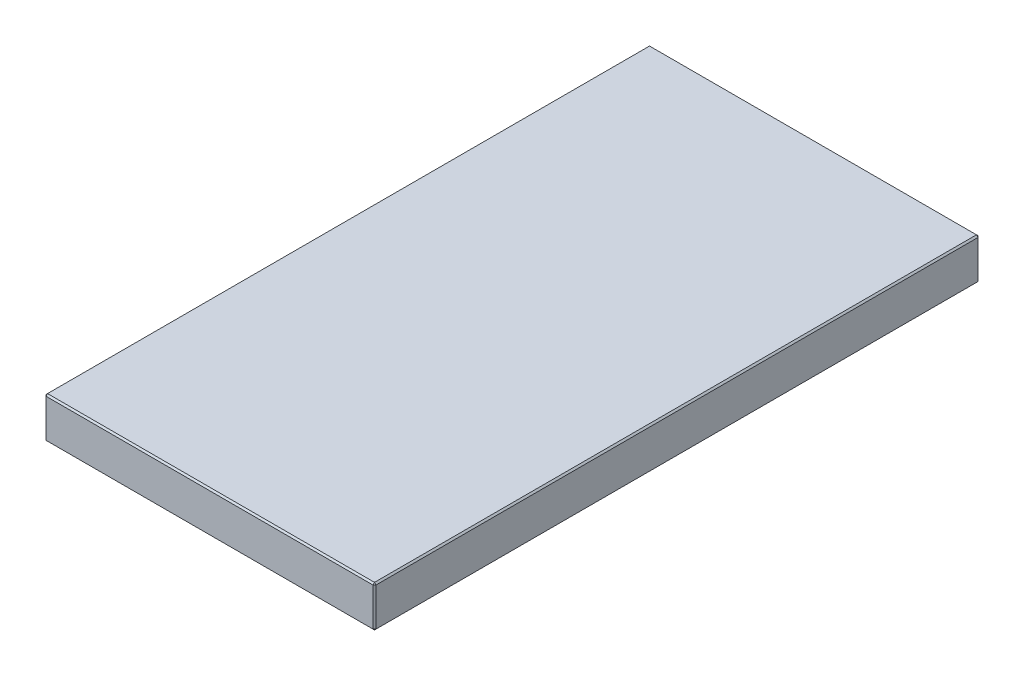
ISO-10303-21;
HEADER;
FILE_DESCRIPTION(('STEP AP214'),'2;1');
FILE_NAME('part.step','',(''),(''),'','','');
FILE_SCHEMA(('AUTOMOTIVE_DESIGN { 1 0 10303 214 1 1 1 1 }'));
ENDSEC;
DATA;
#1=APPLICATION_CONTEXT('core data for automotive mechanical design processes');
#2=APPLICATION_PROTOCOL_DEFINITION('international standard','automotive_design',2000,#1);
#3=PRODUCT_CONTEXT('',#1,'mechanical');
#4=PRODUCT('Part','Part','',(#3));
#5=PRODUCT_RELATED_PRODUCT_CATEGORY('part','',(#4));
#6=PRODUCT_DEFINITION_FORMATION('','',#4);
#7=PRODUCT_DEFINITION_CONTEXT('part definition',#1,'design');
#8=PRODUCT_DEFINITION('design','',#6,#7);
#9=PRODUCT_DEFINITION_SHAPE('','',#8);
#10=(LENGTH_UNIT() NAMED_UNIT(*) SI_UNIT(.MILLI.,.METRE.));
#11=(NAMED_UNIT(*) PLANE_ANGLE_UNIT() SI_UNIT($,.RADIAN.));
#12=(NAMED_UNIT(*) SI_UNIT($,.STERADIAN.) SOLID_ANGLE_UNIT());
#13=UNCERTAINTY_MEASURE_WITH_UNIT(LENGTH_MEASURE(1.E-05),#10,'distance_accuracy_value','');
#14=(GEOMETRIC_REPRESENTATION_CONTEXT(3) GLOBAL_UNCERTAINTY_ASSIGNED_CONTEXT((#13)) GLOBAL_UNIT_ASSIGNED_CONTEXT((#10,
#11,#12)) REPRESENTATION_CONTEXT('',''));
#15=CARTESIAN_POINT('',(0.,0.,0.));
#16=DIRECTION('',(0.,0.,1.));
#17=DIRECTION('',(1.,0.,0.));
#18=AXIS2_PLACEMENT_3D('',#15,#16,#17);
#19=CARTESIAN_POINT('',(108.,27.,198.));
#20=DIRECTION('',(-1.,0.,0.));
#21=DIRECTION('',(0.,0.,1.));
#22=AXIS2_PLACEMENT_3D('',#19,#20,#21);
#23=PLANE('',#22);
#24=DIRECTION('',(0.,0.,-1.));
#25=VECTOR('',#24,1.);
#26=CARTESIAN_POINT('',(108.,1.,-198.));
#27=LINE('',#26,#25);
#28=CARTESIAN_POINT('',(108.,1.,197.));
#29=VERTEX_POINT('',#28);
#30=CARTESIAN_POINT('',(108.,1.,-197.));
#31=VERTEX_POINT('',#30);
#32=EDGE_CURVE('E151',#29,#31,#27,.T.);
#33=ORIENTED_EDGE('',*,*,#32,.T.);
#34=DIRECTION('',(0.,1.,0.));
#35=VECTOR('',#34,1.);
#36=CARTESIAN_POINT('',(108.,27.,-197.));
#37=LINE('',#36,#35);
#38=CARTESIAN_POINT('',(108.,26.,-197.));
#39=VERTEX_POINT('',#38);
#40=EDGE_CURVE('E153',#31,#39,#37,.T.);
#41=ORIENTED_EDGE('',*,*,#40,.T.);
#42=DIRECTION('',(0.,0.,1.));
#43=VECTOR('',#42,1.);
#44=CARTESIAN_POINT('',(108.,26.,198.));
#45=LINE('',#44,#43);
#46=CARTESIAN_POINT('',(108.,26.,197.));
#47=VERTEX_POINT('',#46);
#48=EDGE_CURVE('E147',#39,#47,#45,.T.);
#49=ORIENTED_EDGE('',*,*,#48,.T.);
#50=DIRECTION('',(0.,-1.,0.));
#51=VECTOR('',#50,1.);
#52=CARTESIAN_POINT('',(108.,27.,197.));
#53=LINE('',#52,#51);
#54=EDGE_CURVE('E149',#47,#29,#53,.T.);
#55=ORIENTED_EDGE('',*,*,#54,.T.);
#56=EDGE_LOOP('',(#33,#41,#49,#55));
#57=FACE_BOUND('',#56,.T.);
#58=ADVANCED_FACE('F16',(#57),#23,.F.);
#59=CARTESIAN_POINT('',(-108.,27.,-198.));
#60=DIRECTION('',(0.,0.,1.));
#61=DIRECTION('',(1.,0.,0.));
#62=AXIS2_PLACEMENT_3D('',#59,#60,#61);
#63=PLANE('',#62);
#64=DIRECTION('',(0.,-1.,0.));
#65=VECTOR('',#64,1.);
#66=CARTESIAN_POINT('',(107.,27.,-198.));
#67=LINE('',#66,#65);
#68=CARTESIAN_POINT('',(107.,26.,-198.));
#69=VERTEX_POINT('',#68);
#70=CARTESIAN_POINT('',(107.,1.,-198.));
#71=VERTEX_POINT('',#70);
#72=EDGE_CURVE('E115',#69,#71,#67,.T.);
#73=ORIENTED_EDGE('',*,*,#72,.T.);
#74=DIRECTION('',(-1.,0.,0.));
#75=VECTOR('',#74,1.);
#76=CARTESIAN_POINT('',(-108.,1.,-198.));
#77=LINE('',#76,#75);
#78=CARTESIAN_POINT('',(-107.,1.,-198.));
#79=VERTEX_POINT('',#78);
#80=EDGE_CURVE('E111',#71,#79,#77,.T.);
#81=ORIENTED_EDGE('',*,*,#80,.T.);
#82=DIRECTION('',(0.,1.,0.));
#83=VECTOR('',#82,1.);
#84=CARTESIAN_POINT('',(-107.,27.,-198.));
#85=LINE('',#84,#83);
#86=CARTESIAN_POINT('',(-107.,26.,-198.));
#87=VERTEX_POINT('',#86);
#88=EDGE_CURVE('E103',#79,#87,#85,.T.);
#89=ORIENTED_EDGE('',*,*,#88,.T.);
#90=DIRECTION('',(1.,0.,0.));
#91=VECTOR('',#90,1.);
#92=CARTESIAN_POINT('',(-108.,26.,-198.));
#93=LINE('',#92,#91);
#94=EDGE_CURVE('E108',#87,#69,#93,.T.);
#95=ORIENTED_EDGE('',*,*,#94,.T.);
#96=EDGE_LOOP('',(#73,#81,#89,#95));
#97=FACE_BOUND('',#96,.T.);
#98=ADVANCED_FACE('F106',(#97),#63,.F.);
#99=CARTESIAN_POINT('',(-108.,27.,198.));
#100=DIRECTION('',(1.,0.,0.));
#101=DIRECTION('',(0.,0.,-1.));
#102=AXIS2_PLACEMENT_3D('',#99,#100,#101);
#103=PLANE('',#102);
#104=DIRECTION('',(0.,-1.,0.));
#105=VECTOR('',#104,1.);
#106=CARTESIAN_POINT('',(-108.,27.,-197.));
#107=LINE('',#106,#105);
#108=CARTESIAN_POINT('',(-108.,26.,-197.));
#109=VERTEX_POINT('',#108);
#110=CARTESIAN_POINT('',(-108.,1.,-197.));
#111=VERTEX_POINT('',#110);
#112=EDGE_CURVE('E123',#109,#111,#107,.T.);
#113=ORIENTED_EDGE('',*,*,#112,.T.);
#114=DIRECTION('',(0.,0.,1.));
#115=VECTOR('',#114,1.);
#116=CARTESIAN_POINT('',(-108.,1.,198.));
#117=LINE('',#116,#115);
#118=CARTESIAN_POINT('',(-108.,1.,197.));
#119=VERTEX_POINT('',#118);
#120=EDGE_CURVE('E161',#111,#119,#117,.T.);
#121=ORIENTED_EDGE('',*,*,#120,.T.);
#122=DIRECTION('',(0.,1.,0.));
#123=VECTOR('',#122,1.);
#124=CARTESIAN_POINT('',(-108.,27.,197.));
#125=LINE('',#124,#123);
#126=CARTESIAN_POINT('',(-108.,26.,197.));
#127=VERTEX_POINT('',#126);
#128=EDGE_CURVE('E158',#119,#127,#125,.T.);
#129=ORIENTED_EDGE('',*,*,#128,.T.);
#130=DIRECTION('',(0.,0.,-1.));
#131=VECTOR('',#130,1.);
#132=CARTESIAN_POINT('',(-108.,26.,198.));
#133=LINE('',#132,#131);
#134=EDGE_CURVE('E156',#127,#109,#133,.T.);
#135=ORIENTED_EDGE('',*,*,#134,.T.);
#136=EDGE_LOOP('',(#113,#121,#129,#135));
#137=FACE_BOUND('',#136,.T.);
#138=ADVANCED_FACE('F310',(#137),#103,.F.);
#139=CARTESIAN_POINT('',(-108.,27.,198.));
#140=DIRECTION('',(0.,0.,-1.));
#141=DIRECTION('',(-1.,0.,0.));
#142=AXIS2_PLACEMENT_3D('',#139,#140,#141);
#143=PLANE('',#142);
#144=DIRECTION('',(-1.,0.,0.));
#145=VECTOR('',#144,1.);
#146=CARTESIAN_POINT('',(-108.,26.,198.));
#147=LINE('',#146,#145);
#148=CARTESIAN_POINT('',(107.,26.,198.));
#149=VERTEX_POINT('',#148);
#150=CARTESIAN_POINT('',(-107.,26.,198.));
#151=VERTEX_POINT('',#150);
#152=EDGE_CURVE('E163',#149,#151,#147,.T.);
#153=ORIENTED_EDGE('',*,*,#152,.T.);
#154=DIRECTION('',(0.,-1.,0.));
#155=VECTOR('',#154,1.);
#156=CARTESIAN_POINT('',(-107.,27.,198.));
#157=LINE('',#156,#155);
#158=CARTESIAN_POINT('',(-107.,1.,198.));
#159=VERTEX_POINT('',#158);
#160=EDGE_CURVE('E169',#151,#159,#157,.T.);
#161=ORIENTED_EDGE('',*,*,#160,.T.);
#162=DIRECTION('',(1.,0.,0.));
#163=VECTOR('',#162,1.);
#164=CARTESIAN_POINT('',(108.,1.,198.));
#165=LINE('',#164,#163);
#166=CARTESIAN_POINT('',(107.,1.,198.));
#167=VERTEX_POINT('',#166);
#168=EDGE_CURVE('E167',#159,#167,#165,.T.);
#169=ORIENTED_EDGE('',*,*,#168,.T.);
#170=DIRECTION('',(0.,1.,0.));
#171=VECTOR('',#170,1.);
#172=CARTESIAN_POINT('',(107.,27.,198.));
#173=LINE('',#172,#171);
#174=EDGE_CURVE('E165',#167,#149,#173,.T.);
#175=ORIENTED_EDGE('',*,*,#174,.T.);
#176=EDGE_LOOP('',(#153,#161,#169,#175));
#177=FACE_BOUND('',#176,.T.);
#178=ADVANCED_FACE('F256',(#177),#143,.F.);
#179=CARTESIAN_POINT('',(0.,27.,0.));
#180=DIRECTION('',(0.,-1.,0.));
#181=DIRECTION('',(0.,0.,-1.));
#182=AXIS2_PLACEMENT_3D('',#179,#180,#181);
#183=PLANE('',#182);
#184=DIRECTION('',(0.,0.,1.));
#185=VECTOR('',#184,1.);
#186=CARTESIAN_POINT('',(-107.,27.,0.));
#187=LINE('',#186,#185);
#188=CARTESIAN_POINT('',(-107.,27.,-197.));
#189=VERTEX_POINT('',#188);
#190=CARTESIAN_POINT('',(-107.,27.,197.));
#191=VERTEX_POINT('',#190);
#192=EDGE_CURVE('E25',#189,#191,#187,.T.);
#193=ORIENTED_EDGE('',*,*,#192,.T.);
#194=DIRECTION('',(1.,0.,0.));
#195=VECTOR('',#194,1.);
#196=CARTESIAN_POINT('',(0.,27.,197.));
#197=LINE('',#196,#195);
#198=CARTESIAN_POINT('',(107.,27.,197.));
#199=VERTEX_POINT('',#198);
#200=EDGE_CURVE('E10',#191,#199,#197,.T.);
#201=ORIENTED_EDGE('',*,*,#200,.T.);
#202=DIRECTION('',(0.,0.,-1.));
#203=VECTOR('',#202,1.);
#204=CARTESIAN_POINT('',(107.,27.,0.));
#205=LINE('',#204,#203);
#206=CARTESIAN_POINT('',(107.,27.,-197.));
#207=VERTEX_POINT('',#206);
#208=EDGE_CURVE('E181',#199,#207,#205,.T.);
#209=ORIENTED_EDGE('',*,*,#208,.T.);
#210=DIRECTION('',(-1.,0.,0.));
#211=VECTOR('',#210,1.);
#212=CARTESIAN_POINT('',(0.,27.,-197.));
#213=LINE('',#212,#211);
#214=EDGE_CURVE('E36',#207,#189,#213,.T.);
#215=ORIENTED_EDGE('',*,*,#214,.T.);
#216=EDGE_LOOP('',(#193,#201,#209,#215));
#217=FACE_BOUND('',#216,.T.);
#218=ADVANCED_FACE('F271',(#217),#183,.F.);
#219=CARTESIAN_POINT('',(0.,0.,0.));
#220=DIRECTION('',(0.,-1.,0.));
#221=DIRECTION('',(0.,0.,-1.));
#222=AXIS2_PLACEMENT_3D('',#219,#220,#221);
#223=PLANE('',#222);
#224=DIRECTION('',(0.,0.,-1.));
#225=VECTOR('',#224,1.);
#226=CARTESIAN_POINT('',(-107.,0.,-198.));
#227=LINE('',#226,#225);
#228=CARTESIAN_POINT('',(-107.,0.,197.));
#229=VERTEX_POINT('',#228);
#230=CARTESIAN_POINT('',(-107.,0.,-197.));
#231=VERTEX_POINT('',#230);
#232=EDGE_CURVE('E176',#229,#231,#227,.T.);
#233=ORIENTED_EDGE('',*,*,#232,.T.);
#234=DIRECTION('',(1.,0.,0.));
#235=VECTOR('',#234,1.);
#236=CARTESIAN_POINT('',(108.,0.,-197.));
#237=LINE('',#236,#235);
#238=CARTESIAN_POINT('',(107.,0.,-197.));
#239=VERTEX_POINT('',#238);
#240=EDGE_CURVE('E178',#231,#239,#237,.T.);
#241=ORIENTED_EDGE('',*,*,#240,.T.);
#242=DIRECTION('',(0.,0.,1.));
#243=VECTOR('',#242,1.);
#244=CARTESIAN_POINT('',(107.,0.,198.));
#245=LINE('',#244,#243);
#246=CARTESIAN_POINT('',(107.,0.,197.));
#247=VERTEX_POINT('',#246);
#248=EDGE_CURVE('E172',#239,#247,#245,.T.);
#249=ORIENTED_EDGE('',*,*,#248,.T.);
#250=DIRECTION('',(-1.,0.,0.));
#251=VECTOR('',#250,1.);
#252=CARTESIAN_POINT('',(-108.,0.,197.));
#253=LINE('',#252,#251);
#254=EDGE_CURVE('E174',#247,#229,#253,.T.);
#255=ORIENTED_EDGE('',*,*,#254,.T.);
#256=EDGE_LOOP('',(#233,#241,#249,#255));
#257=FACE_BOUND('',#256,.T.);
#258=ADVANCED_FACE('F247',(#257),#223,.T.);
#259=CARTESIAN_POINT('',(-107.,27.,198.));
#260=DIRECTION('',(0.707106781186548,0.,-0.707106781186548));
#261=DIRECTION('',(0.,-1.,0.));
#262=AXIS2_PLACEMENT_3D('',#259,#260,#261);
#263=PLANE('',#262);
#264=DIRECTION('',(-0.707106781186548,0.,-0.707106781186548));
#265=VECTOR('',#264,1.);
#266=CARTESIAN_POINT('',(-108.,26.,197.));
#267=LINE('',#266,#265);
#268=EDGE_CURVE('E20',#127,#151,#267,.F.);
#269=ORIENTED_EDGE('',*,*,#268,.F.);
#270=ORIENTED_EDGE('',*,*,#128,.F.);
#271=DIRECTION('',(0.707106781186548,0.,0.707106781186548));
#272=VECTOR('',#271,1.);
#273=CARTESIAN_POINT('',(-107.,1.,198.));
#274=LINE('',#273,#272);
#275=EDGE_CURVE('E143',#159,#119,#274,.F.);
#276=ORIENTED_EDGE('',*,*,#275,.F.);
#277=ORIENTED_EDGE('',*,*,#160,.F.);
#278=EDGE_LOOP('',(#269,#270,#276,#277));
#279=FACE_BOUND('',#278,.T.);
#280=ADVANCED_FACE('F18',(#279),#263,.F.);
#281=CARTESIAN_POINT('',(-108.,26.,197.));
#282=DIRECTION('',(-0.577350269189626,0.577350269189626,0.577350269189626));
#283=DIRECTION('',(0.707106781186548,0.,0.707106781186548));
#284=AXIS2_PLACEMENT_3D('',#281,#282,#283);
#285=PLANE('',#284);
#286=DIRECTION('',(0.707106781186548,0.707106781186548,0.));
#287=VECTOR('',#286,1.);
#288=CARTESIAN_POINT('',(-108.,26.,197.));
#289=LINE('',#288,#287);
#290=EDGE_CURVE('E227',#127,#191,#289,.T.);
#291=ORIENTED_EDGE('',*,*,#290,.F.);
#292=ORIENTED_EDGE('',*,*,#268,.T.);
#293=DIRECTION('',(0.,-0.707106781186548,0.707106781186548));
#294=VECTOR('',#293,1.);
#295=CARTESIAN_POINT('',(-107.,26.5,197.5));
#296=LINE('',#295,#294);
#297=EDGE_CURVE('E229',#191,#151,#296,.T.);
#298=ORIENTED_EDGE('',*,*,#297,.F.);
#299=EDGE_LOOP('',(#291,#292,#298));
#300=FACE_BOUND('',#299,.T.);
#301=ADVANCED_FACE('F460',(#300),#285,.T.);
#302=CARTESIAN_POINT('',(-107.,1.,198.));
#303=DIRECTION('',(-0.577350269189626,-0.577350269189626,0.577350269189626));
#304=DIRECTION('',(0.707106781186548,0.,0.707106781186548));
#305=AXIS2_PLACEMENT_3D('',#302,#303,#304);
#306=PLANE('',#305);
#307=DIRECTION('',(0.,0.707106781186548,0.707106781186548));
#308=VECTOR('',#307,1.);
#309=CARTESIAN_POINT('',(-107.,1.,198.));
#310=LINE('',#309,#308);
#311=EDGE_CURVE('E221',#159,#229,#310,.F.);
#312=ORIENTED_EDGE('',*,*,#311,.F.);
#313=ORIENTED_EDGE('',*,*,#275,.T.);
#314=DIRECTION('',(0.707106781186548,-0.707106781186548,0.));
#315=VECTOR('',#314,1.);
#316=CARTESIAN_POINT('',(-107.5,0.5,197.));
#317=LINE('',#316,#315);
#318=EDGE_CURVE('E224',#229,#119,#317,.F.);
#319=ORIENTED_EDGE('',*,*,#318,.F.);
#320=EDGE_LOOP('',(#312,#313,#319));
#321=FACE_BOUND('',#320,.T.);
#322=ADVANCED_FACE('F236',(#321),#306,.T.);
#323=CARTESIAN_POINT('',(0.,27.,197.));
#324=DIRECTION('',(0.,-0.707106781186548,-0.707106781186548));
#325=DIRECTION('',(1.,0.,0.));
#326=AXIS2_PLACEMENT_3D('',#323,#324,#325);
#327=PLANE('',#326);
#328=ORIENTED_EDGE('',*,*,#297,.T.);
#329=ORIENTED_EDGE('',*,*,#152,.F.);
#330=DIRECTION('',(0.,0.707106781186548,-0.707106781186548));
#331=VECTOR('',#330,1.);
#332=CARTESIAN_POINT('',(107.,26.,198.));
#333=LINE('',#332,#331);
#334=EDGE_CURVE('E215',#199,#149,#333,.F.);
#335=ORIENTED_EDGE('',*,*,#334,.F.);
#336=ORIENTED_EDGE('',*,*,#200,.F.);
#337=EDGE_LOOP('',(#328,#329,#335,#336));
#338=FACE_BOUND('',#337,.T.);
#339=ADVANCED_FACE('F270',(#338),#327,.F.);
#340=CARTESIAN_POINT('',(-107.,27.,0.));
#341=DIRECTION('',(0.707106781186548,-0.707106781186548,0.));
#342=DIRECTION('',(0.,0.,1.));
#343=AXIS2_PLACEMENT_3D('',#340,#341,#342);
#344=PLANE('',#343);
#345=ORIENTED_EDGE('',*,*,#290,.T.);
#346=ORIENTED_EDGE('',*,*,#192,.F.);
#347=DIRECTION('',(-0.707106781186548,-0.707106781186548,0.));
#348=VECTOR('',#347,1.);
#349=CARTESIAN_POINT('',(-107.5,26.5,-197.));
#350=LINE('',#349,#348);
#351=EDGE_CURVE('E127',#109,#189,#350,.F.);
#352=ORIENTED_EDGE('',*,*,#351,.F.);
#353=ORIENTED_EDGE('',*,*,#134,.F.);
#354=EDGE_LOOP('',(#345,#346,#352,#353));
#355=FACE_BOUND('',#354,.T.);
#356=ADVANCED_FACE('F437',(#355),#344,.F.);
#357=CARTESIAN_POINT('',(-108.,27.,-197.));
#358=DIRECTION('',(0.707106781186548,0.,0.707106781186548));
#359=DIRECTION('',(0.,-1.,0.));
#360=AXIS2_PLACEMENT_3D('',#357,#358,#359);
#361=PLANE('',#360);
#362=DIRECTION('',(-0.707106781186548,0.,0.707106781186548));
#363=VECTOR('',#362,1.);
#364=CARTESIAN_POINT('',(-108.,1.,-197.));
#365=LINE('',#364,#363);
#366=EDGE_CURVE('E128',#111,#79,#365,.F.);
#367=ORIENTED_EDGE('',*,*,#366,.F.);
#368=ORIENTED_EDGE('',*,*,#112,.F.);
#369=DIRECTION('',(0.707106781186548,0.,-0.707106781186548));
#370=VECTOR('',#369,1.);
#371=CARTESIAN_POINT('',(-107.,26.,-198.));
#372=LINE('',#371,#370);
#373=EDGE_CURVE('E119',#87,#109,#372,.F.);
#374=ORIENTED_EDGE('',*,*,#373,.F.);
#375=ORIENTED_EDGE('',*,*,#88,.F.);
#376=EDGE_LOOP('',(#367,#368,#374,#375));
#377=FACE_BOUND('',#376,.T.);
#378=ADVANCED_FACE('F121',(#377),#361,.F.);
#379=CARTESIAN_POINT('',(-108.,1.,198.));
#380=DIRECTION('',(-0.707106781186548,-0.707106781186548,0.));
#381=DIRECTION('',(0.,0.,-1.));
#382=AXIS2_PLACEMENT_3D('',#379,#380,#381);
#383=PLANE('',#382);
#384=ORIENTED_EDGE('',*,*,#318,.T.);
#385=ORIENTED_EDGE('',*,*,#120,.F.);
#386=DIRECTION('',(-0.707106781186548,0.707106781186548,0.));
#387=VECTOR('',#386,1.);
#388=CARTESIAN_POINT('',(-108.,1.,-197.));
#389=LINE('',#388,#387);
#390=EDGE_CURVE('E211',#231,#111,#389,.T.);
#391=ORIENTED_EDGE('',*,*,#390,.F.);
#392=ORIENTED_EDGE('',*,*,#232,.F.);
#393=EDGE_LOOP('',(#384,#385,#391,#392));
#394=FACE_BOUND('',#393,.T.);
#395=ADVANCED_FACE('F243',(#394),#383,.T.);
#396=CARTESIAN_POINT('',(-108.,1.,198.));
#397=DIRECTION('',(0.,-0.707106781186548,0.707106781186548));
#398=DIRECTION('',(-1.,0.,0.));
#399=AXIS2_PLACEMENT_3D('',#396,#397,#398);
#400=PLANE('',#399);
#401=ORIENTED_EDGE('',*,*,#311,.T.);
#402=ORIENTED_EDGE('',*,*,#254,.F.);
#403=DIRECTION('',(0.,-0.707106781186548,-0.707106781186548));
#404=VECTOR('',#403,1.);
#405=CARTESIAN_POINT('',(107.,1.,198.));
#406=LINE('',#405,#404);
#407=EDGE_CURVE('E208',#167,#247,#406,.T.);
#408=ORIENTED_EDGE('',*,*,#407,.F.);
#409=ORIENTED_EDGE('',*,*,#168,.F.);
#410=EDGE_LOOP('',(#401,#402,#408,#409));
#411=FACE_BOUND('',#410,.T.);
#412=ADVANCED_FACE('F253',(#411),#400,.T.);
#413=CARTESIAN_POINT('',(108.,27.,197.));
#414=DIRECTION('',(-0.707106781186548,0.,-0.707106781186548));
#415=DIRECTION('',(0.,-1.,0.));
#416=AXIS2_PLACEMENT_3D('',#413,#414,#415);
#417=PLANE('',#416);
#418=DIRECTION('',(-0.707106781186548,0.,0.707106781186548));
#419=VECTOR('',#418,1.);
#420=CARTESIAN_POINT('',(107.,26.,198.));
#421=LINE('',#420,#419);
#422=EDGE_CURVE('E218',#149,#47,#421,.F.);
#423=ORIENTED_EDGE('',*,*,#422,.F.);
#424=ORIENTED_EDGE('',*,*,#174,.F.);
#425=DIRECTION('',(0.707106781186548,0.,-0.707106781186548));
#426=VECTOR('',#425,1.);
#427=CARTESIAN_POINT('',(107.,1.,198.));
#428=LINE('',#427,#426);
#429=EDGE_CURVE('E205',#29,#167,#428,.F.);
#430=ORIENTED_EDGE('',*,*,#429,.F.);
#431=ORIENTED_EDGE('',*,*,#54,.F.);
#432=EDGE_LOOP('',(#423,#424,#430,#431));
#433=FACE_BOUND('',#432,.T.);
#434=ADVANCED_FACE('F261',(#433),#417,.F.);
#435=CARTESIAN_POINT('',(107.,26.,198.));
#436=DIRECTION('',(0.577350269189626,0.577350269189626,0.577350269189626));
#437=DIRECTION('',(0.707106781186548,0.,-0.707106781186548));
#438=AXIS2_PLACEMENT_3D('',#435,#436,#437);
#439=PLANE('',#438);
#440=ORIENTED_EDGE('',*,*,#334,.T.);
#441=ORIENTED_EDGE('',*,*,#422,.T.);
#442=DIRECTION('',(0.707106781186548,-0.707106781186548,0.));
#443=VECTOR('',#442,1.);
#444=CARTESIAN_POINT('',(107.5,26.5,197.));
#445=LINE('',#444,#443);
#446=EDGE_CURVE('E134',#199,#47,#445,.T.);
#447=ORIENTED_EDGE('',*,*,#446,.F.);
#448=EDGE_LOOP('',(#440,#441,#447));
#449=FACE_BOUND('',#448,.T.);
#450=ADVANCED_FACE('F267',(#449),#439,.T.);
#451=CARTESIAN_POINT('',(-107.,26.,-198.));
#452=DIRECTION('',(-0.577350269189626,0.577350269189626,-0.577350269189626));
#453=DIRECTION('',(-0.707106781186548,0.,0.707106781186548));
#454=AXIS2_PLACEMENT_3D('',#451,#452,#453);
#455=PLANE('',#454);
#456=ORIENTED_EDGE('',*,*,#373,.T.);
#457=ORIENTED_EDGE('',*,*,#351,.T.);
#458=DIRECTION('',(0.,0.707106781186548,0.707106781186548));
#459=VECTOR('',#458,1.);
#460=CARTESIAN_POINT('',(-107.,26.,-198.));
#461=LINE('',#460,#459);
#462=EDGE_CURVE('E131',#87,#189,#461,.T.);
#463=ORIENTED_EDGE('',*,*,#462,.F.);
#464=EDGE_LOOP('',(#456,#457,#463));
#465=FACE_BOUND('',#464,.T.);
#466=ADVANCED_FACE('F132',(#465),#455,.T.);
#467=CARTESIAN_POINT('',(-108.,1.,-197.));
#468=DIRECTION('',(-0.577350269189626,-0.577350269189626,-0.577350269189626));
#469=DIRECTION('',(-0.707106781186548,0.,0.707106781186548));
#470=AXIS2_PLACEMENT_3D('',#467,#468,#469);
#471=PLANE('',#470);
#472=ORIENTED_EDGE('',*,*,#390,.T.);
#473=ORIENTED_EDGE('',*,*,#366,.T.);
#474=DIRECTION('',(0.,-0.707106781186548,0.707106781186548));
#475=VECTOR('',#474,1.);
#476=CARTESIAN_POINT('',(-107.,0.5,-197.5));
#477=LINE('',#476,#475);
#478=EDGE_CURVE('E135',#231,#79,#477,.F.);
#479=ORIENTED_EDGE('',*,*,#478,.F.);
#480=EDGE_LOOP('',(#472,#473,#479));
#481=FACE_BOUND('',#480,.T.);
#482=ADVANCED_FACE('F290',(#481),#471,.T.);
#483=CARTESIAN_POINT('',(107.,1.,198.));
#484=DIRECTION('',(0.577350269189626,-0.577350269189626,0.577350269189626));
#485=DIRECTION('',(0.707106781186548,0.,-0.707106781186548));
#486=AXIS2_PLACEMENT_3D('',#483,#484,#485);
#487=PLANE('',#486);
#488=ORIENTED_EDGE('',*,*,#429,.T.);
#489=ORIENTED_EDGE('',*,*,#407,.T.);
#490=DIRECTION('',(0.707106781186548,0.707106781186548,0.));
#491=VECTOR('',#490,1.);
#492=CARTESIAN_POINT('',(107.5,0.5,197.));
#493=LINE('',#492,#491);
#494=EDGE_CURVE('E198',#29,#247,#493,.F.);
#495=ORIENTED_EDGE('',*,*,#494,.F.);
#496=EDGE_LOOP('',(#488,#489,#495));
#497=FACE_BOUND('',#496,.T.);
#498=ADVANCED_FACE('F292',(#497),#487,.T.);
#499=CARTESIAN_POINT('',(107.,27.,0.));
#500=DIRECTION('',(-0.707106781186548,-0.707106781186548,0.));
#501=DIRECTION('',(0.,0.,-1.));
#502=AXIS2_PLACEMENT_3D('',#499,#500,#501);
#503=PLANE('',#502);
#504=ORIENTED_EDGE('',*,*,#446,.T.);
#505=ORIENTED_EDGE('',*,*,#48,.F.);
#506=DIRECTION('',(-0.707106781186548,0.707106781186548,0.));
#507=VECTOR('',#506,1.);
#508=CARTESIAN_POINT('',(108.,26.,-197.));
#509=LINE('',#508,#507);
#510=EDGE_CURVE('E195',#207,#39,#509,.F.);
#511=ORIENTED_EDGE('',*,*,#510,.F.);
#512=ORIENTED_EDGE('',*,*,#208,.F.);
#513=EDGE_LOOP('',(#504,#505,#511,#512));
#514=FACE_BOUND('',#513,.T.);
#515=ADVANCED_FACE('F275',(#514),#503,.F.);
#516=CARTESIAN_POINT('',(0.,27.,-197.));
#517=DIRECTION('',(0.,-0.707106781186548,0.707106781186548));
#518=DIRECTION('',(-1.,0.,0.));
#519=AXIS2_PLACEMENT_3D('',#516,#517,#518);
#520=PLANE('',#519);
#521=ORIENTED_EDGE('',*,*,#462,.T.);
#522=ORIENTED_EDGE('',*,*,#214,.F.);
#523=DIRECTION('',(0.,-0.707106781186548,-0.707106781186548));
#524=VECTOR('',#523,1.);
#525=CARTESIAN_POINT('',(107.,26.5,-197.5));
#526=LINE('',#525,#524);
#527=EDGE_CURVE('E139',#69,#207,#526,.F.);
#528=ORIENTED_EDGE('',*,*,#527,.F.);
#529=ORIENTED_EDGE('',*,*,#94,.F.);
#530=EDGE_LOOP('',(#521,#522,#528,#529));
#531=FACE_BOUND('',#530,.T.);
#532=ADVANCED_FACE('F137',(#531),#520,.F.);
#533=CARTESIAN_POINT('',(-108.,1.,-198.));
#534=DIRECTION('',(0.,-0.707106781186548,-0.707106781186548));
#535=DIRECTION('',(1.,0.,0.));
#536=AXIS2_PLACEMENT_3D('',#533,#534,#535);
#537=PLANE('',#536);
#538=ORIENTED_EDGE('',*,*,#478,.T.);
#539=ORIENTED_EDGE('',*,*,#80,.F.);
#540=DIRECTION('',(0.,0.707106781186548,-0.707106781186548));
#541=VECTOR('',#540,1.);
#542=CARTESIAN_POINT('',(107.,1.,-198.));
#543=LINE('',#542,#541);
#544=EDGE_CURVE('E191',#239,#71,#543,.T.);
#545=ORIENTED_EDGE('',*,*,#544,.F.);
#546=ORIENTED_EDGE('',*,*,#240,.F.);
#547=EDGE_LOOP('',(#538,#539,#545,#546));
#548=FACE_BOUND('',#547,.T.);
#549=ADVANCED_FACE('F288',(#548),#537,.T.);
#550=CARTESIAN_POINT('',(108.,1.,198.));
#551=DIRECTION('',(0.707106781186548,-0.707106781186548,0.));
#552=DIRECTION('',(0.,0.,1.));
#553=AXIS2_PLACEMENT_3D('',#550,#551,#552);
#554=PLANE('',#553);
#555=ORIENTED_EDGE('',*,*,#494,.T.);
#556=ORIENTED_EDGE('',*,*,#248,.F.);
#557=DIRECTION('',(-0.707106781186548,-0.707106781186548,0.));
#558=VECTOR('',#557,1.);
#559=CARTESIAN_POINT('',(107.5,0.5,-197.));
#560=LINE('',#559,#558);
#561=EDGE_CURVE('E189',#31,#239,#560,.T.);
#562=ORIENTED_EDGE('',*,*,#561,.F.);
#563=ORIENTED_EDGE('',*,*,#32,.F.);
#564=EDGE_LOOP('',(#555,#556,#562,#563));
#565=FACE_BOUND('',#564,.T.);
#566=ADVANCED_FACE('F320',(#565),#554,.T.);
#567=CARTESIAN_POINT('',(108.,26.,-197.));
#568=DIRECTION('',(0.577350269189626,0.577350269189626,-0.577350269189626));
#569=DIRECTION('',(-0.707106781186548,0.,-0.707106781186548));
#570=AXIS2_PLACEMENT_3D('',#567,#568,#569);
#571=PLANE('',#570);
#572=ORIENTED_EDGE('',*,*,#527,.T.);
#573=ORIENTED_EDGE('',*,*,#510,.T.);
#574=DIRECTION('',(0.707106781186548,0.,0.707106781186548));
#575=VECTOR('',#574,1.);
#576=CARTESIAN_POINT('',(108.,26.,-197.));
#577=LINE('',#576,#575);
#578=EDGE_CURVE('E187',#69,#39,#577,.T.);
#579=ORIENTED_EDGE('',*,*,#578,.F.);
#580=EDGE_LOOP('',(#572,#573,#579));
#581=FACE_BOUND('',#580,.T.);
#582=ADVANCED_FACE('F277',(#581),#571,.T.);
#583=CARTESIAN_POINT('',(107.,1.,-198.));
#584=DIRECTION('',(0.577350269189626,-0.577350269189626,-0.577350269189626));
#585=DIRECTION('',(-0.707106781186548,0.,-0.707106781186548));
#586=AXIS2_PLACEMENT_3D('',#583,#584,#585);
#587=PLANE('',#586);
#588=ORIENTED_EDGE('',*,*,#561,.T.);
#589=ORIENTED_EDGE('',*,*,#544,.T.);
#590=DIRECTION('',(-0.707106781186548,0.,-0.707106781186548));
#591=VECTOR('',#590,1.);
#592=CARTESIAN_POINT('',(107.,1.,-198.));
#593=LINE('',#592,#591);
#594=EDGE_CURVE('E185',#31,#71,#593,.T.);
#595=ORIENTED_EDGE('',*,*,#594,.F.);
#596=EDGE_LOOP('',(#588,#589,#595));
#597=FACE_BOUND('',#596,.T.);
#598=ADVANCED_FACE('F285',(#597),#587,.T.);
#599=CARTESIAN_POINT('',(107.,27.,-198.));
#600=DIRECTION('',(-0.707106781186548,0.,0.707106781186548));
#601=DIRECTION('',(0.,-1.,0.));
#602=AXIS2_PLACEMENT_3D('',#599,#600,#601);
#603=PLANE('',#602);
#604=ORIENTED_EDGE('',*,*,#578,.T.);
#605=ORIENTED_EDGE('',*,*,#40,.F.);
#606=ORIENTED_EDGE('',*,*,#594,.T.);
#607=ORIENTED_EDGE('',*,*,#72,.F.);
#608=EDGE_LOOP('',(#604,#605,#606,#607));
#609=FACE_BOUND('',#608,.T.);
#610=ADVANCED_FACE('F281',(#609),#603,.F.);
#611=CLOSED_SHELL('',(#58,#98,#138,#178,#218,#258,#280,#301,#322,#339,#356,#378,#395,#412,#434,
#450,#466,#482,#498,#515,#532,#549,#566,#582,#598,#610));
#612=MANIFOLD_SOLID_BREP('B1',#611);
#613=ADVANCED_BREP_SHAPE_REPRESENTATION('',(#18,#612),#14);
#614=SHAPE_DEFINITION_REPRESENTATION(#9,#613);
ENDSEC;
END-ISO-10303-21;
